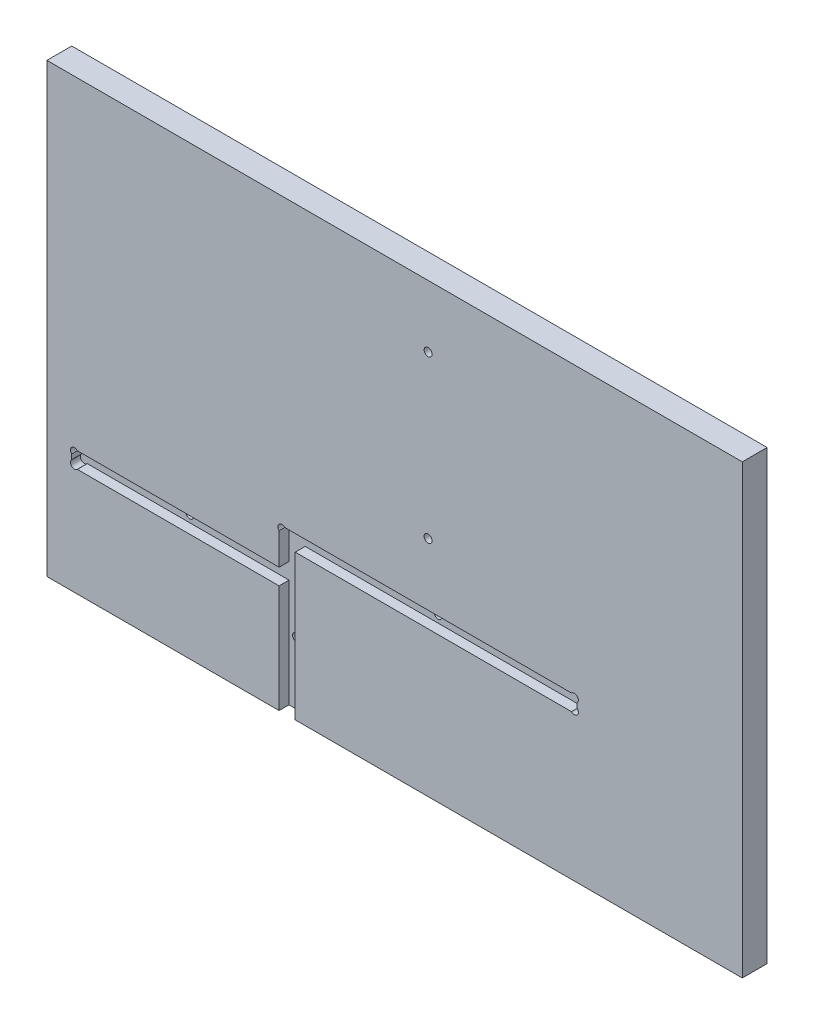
from build123d import *

# Parameters (mm, degrees)
ESQUISSE1_W             = 280
ESQUISSE1_H             = 180
EXTRUSION1_DEPTH        = 10
ESQUISSE2_W             = 120
ESQUISSE2_H             = 6.5
ESQUISSE2_W_2           = 90
ENL_V_MAT_EXTRU_1_DEPTH = 4
ESQUISSE3_R             = 1.6
ENL_V_MAT_EXTRU_2_DEPTH = 4
ESQUISSE4_R             = 1.6
ENL_V_MAT_EXTRU_3_DEPTH = 253.586618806
ESQUISSE5_W             = 6.5
ESQUISSE5_H             = 58.5
ENL_V_MAT_EXTRU_4_DEPTH = 4
ESQUISSE6_R             = 1.6
ENL_V_MAT_EXTRU_5_DEPTH = 253.459897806


with BuildPart() as part:
    # Esquisse1 → Extrusion1 (new body)
    with BuildSketch(Plane.XY):
        with Locations((70, -50)):
            Rectangle(ESQUISSE1_W, ESQUISSE1_H)
    extrude(amount=EXTRUSION1_DEPTH)

    # Esquisse2 → Enl_v. mat.-Extru.1 (cut)
    with BuildSketch(Plane.XY.offset(10)):
        with Locations((83.5, -78.25)):
            Rectangle(ESQUISSE2_W, ESQUISSE2_H)
        with Locations((-15, -93.25)):
            Rectangle(ESQUISSE2_W_2, ESQUISSE2_H)
    extrude(amount=-ENL_V_MAT_EXTRU_1_DEPTH, mode=Mode.SUBTRACT)

    # Esquisse3 → Enl_v. mat.-Extru.2 (cut)
    with BuildSketch(Plane.XY.offset(10)):
        with Locations((142.4, -76.1)):
            Circle(ESQUISSE3_R)
        with Locations((142.4, -80.4)):
            Circle(ESQUISSE3_R)
        with Locations((24.6, -76.1)):
            Circle(ESQUISSE3_R)
        with Locations((-58.9, -91.1)):
            Circle(ESQUISSE3_R)
        with Locations((-58.9, -95.4)):
            Circle(ESQUISSE3_R)
    extrude(amount=-ENL_V_MAT_EXTRU_2_DEPTH, mode=Mode.SUBTRACT)

    # Esquisse4 → Enl_v. mat.-Extru.3 (cut, through all)
    with BuildSketch(Plane.XY.offset(10)):
        with Locations((83.5, -50)):
            Circle(ESQUISSE4_R)
        with Locations((83.5, 15)):
            Circle(ESQUISSE4_R)
    extrude(amount=-ENL_V_MAT_EXTRU_3_DEPTH, mode=Mode.SUBTRACT)

    # Esquisse5 → Enl_v. mat.-Extru.4 (cut)
    with BuildSketch(Plane.XY.offset(10)):
        with Locations((26.75, -110.75)):
            Rectangle(ESQUISSE5_W, ESQUISSE5_H)
    extrude(amount=-ENL_V_MAT_EXTRU_4_DEPTH, mode=Mode.SUBTRACT)

    # Esquisse6 → Enl_v. mat.-Extru.5 (cut, through all)
    with BuildSketch(Plane.XY.offset(6)):
        with Locations((83.5, -78.5)):
            Circle(ESQUISSE6_R)
        with Locations((26.5, -115)):
            Circle(ESQUISSE6_R)
        with Locations((-16.5, -93.5)):
            Circle(ESQUISSE6_R)
    extrude(amount=-ENL_V_MAT_EXTRU_5_DEPTH, mode=Mode.SUBTRACT)


solid = part.part
